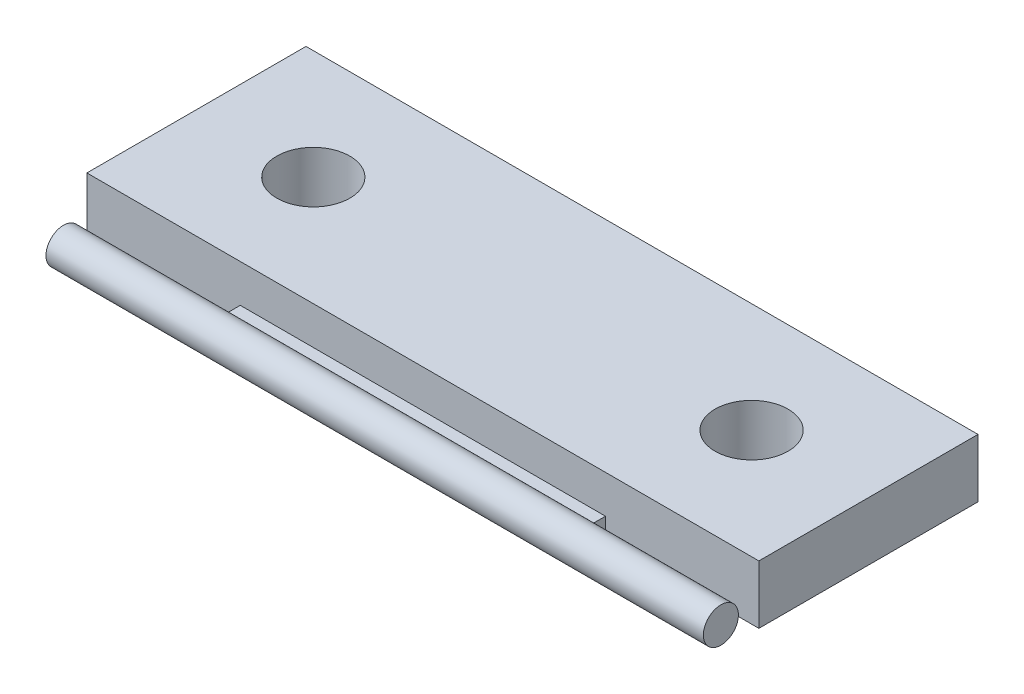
from build123d import *

# Parameters (mm, degrees)
SKETCH1_W                = 50
SKETCH1_H                = 15
BOSS_EXTRUDE1_DEPTH      = 2
BOSS_EXTRUDE2_START      = -12.5
BOSS_EXTRUDE2_DEPTH      = 25
BOSS_EXTRUDE3_DEPTH      = 10
BOSS_EXTRUDE3_DEPTH_BACK = 35
SKETCH3_R                = 1.2
SKETCH5_R                = 2.5
CUT_EXTRUDE1_DEPTH       = 10
BOSS_EXTRUDE5_START      = 2
SKETCH7_W                = 50
SKETCH7_H                = 15
SKETCH7_R                = 2.5
BOSS_EXTRUDE5_DEPTH      = 2
SKETCH8_W                = 6.525341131
SKETCH8_H                = 27.439896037
SKETCH8_W_2              = 6.943632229
CUT_EXTRUDE2_DEPTH       = 10


with BuildPart() as part:
    # Sketch1 → Boss-Extrude1 (new body)
    with BuildSketch(Plane(origin=(0, 0, 0), x_dir=(1, 0, 0), z_dir=(0, 1, 0))):
        Rectangle(SKETCH1_W, SKETCH1_H)
    extrude(amount=BOSS_EXTRUDE1_DEPTH)

    # Sketch2 → Boss-Extrude2 (add)
    with BuildSketch(Plane(origin=(25, 0, 0), x_dir=(0, 0, -1), z_dir=(1, 0, 0)).offset(BOSS_EXTRUDE2_START)):
        with BuildLine():
            Line((-7.5, 1.4), (-7.5, 0.6))
            Line((-7.5, 0.6), (-8.46862915, 0.6))
            ThreePointArc((-8.46862915, 0.6), (-10.8, 1), (-8.46862915, 1.4))
            Line((-8.46862915, 1.4), (-7.5, 1.4))
        make_face()
    extrude(amount=-BOSS_EXTRUDE2_DEPTH)

    # Sketch3 → Boss-Extrude3 (add, two sides: drawn at the far end of the back side and taken through both)
    with BuildSketch(Plane(origin=(12.5, 0, 0), x_dir=(0, 0, -1), z_dir=(1, 0, 0)).offset(-BOSS_EXTRUDE3_DEPTH_BACK)):
        with Locations((-9.6, 1)):
            Circle(SKETCH3_R)
    extrude(amount=BOSS_EXTRUDE3_DEPTH + BOSS_EXTRUDE3_DEPTH_BACK)

    # Sketch5 → Cut-Extrude1 (cut)
    with BuildSketch(Plane(origin=(0, 2, 0), x_dir=(1, 0, 0), z_dir=(0, 1, 0))):
        with Locations(Location((-15, 0, 0), (0, 0, 270))):
            Circle(SKETCH5_R)
        with Locations(Location((15, 0, 0), (0, 0, 270))):
            Circle(SKETCH5_R)
    extrude(amount=-CUT_EXTRUDE1_DEPTH, mode=Mode.SUBTRACT)

    # Sketch7 → Boss-Extrude5 (add)
    with BuildSketch(Plane(origin=(0, 2, 0), x_dir=(1, 0, 0), z_dir=(0, 1, 0)).offset(BOSS_EXTRUDE5_START)):
        Rectangle(SKETCH7_W, SKETCH7_H)
        with Locations(Location((15, 0, 0), (0, 0, 270))):
            Circle(SKETCH7_R, mode=Mode.SUBTRACT)
        with Locations(Location((-15, 0, 0), (0, 0, 270))):
            Circle(SKETCH7_R, mode=Mode.SUBTRACT)
    extrude(amount=-BOSS_EXTRUDE5_DEPTH)

    # Sketch8 → Cut-Extrude2 (cut)
    with BuildSketch(Plane(origin=(0, 4, 0), x_dir=(1, 0, 0), z_dir=(0, 1, 0))):
        with Locations((-26.262670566, -2.904873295)):
            Rectangle(SKETCH8_W, SKETCH8_H)
        with Locations((26.471816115, -2.904873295)):
            Rectangle(SKETCH8_W_2, SKETCH8_H)
    extrude(amount=-CUT_EXTRUDE2_DEPTH, mode=Mode.SUBTRACT)


solid = part.part
